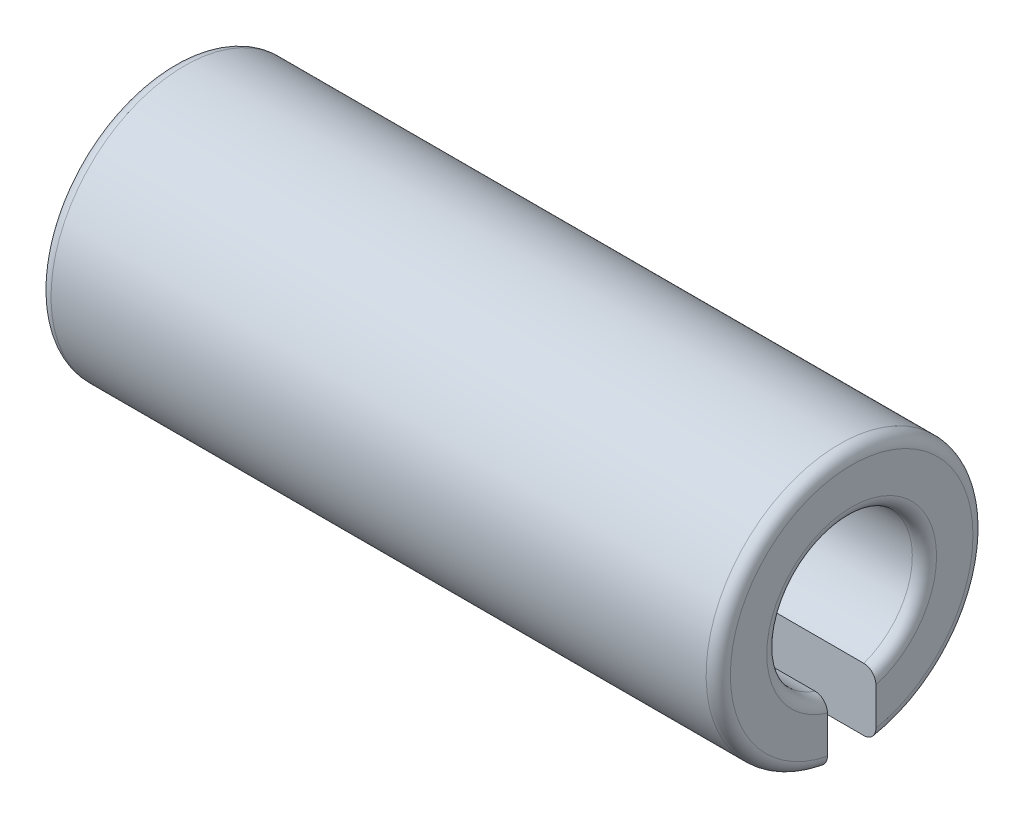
ISO-10303-21;
HEADER;
FILE_DESCRIPTION(('STEP AP214'),'2;1');
FILE_NAME('part.step','',(''),(''),'','','');
FILE_SCHEMA(('AUTOMOTIVE_DESIGN { 1 0 10303 214 1 1 1 1 }'));
ENDSEC;
DATA;
#1=APPLICATION_CONTEXT('core data for automotive mechanical design processes');
#2=APPLICATION_PROTOCOL_DEFINITION('international standard','automotive_design',2000,#1);
#3=PRODUCT_CONTEXT('',#1,'mechanical');
#4=PRODUCT('Part','Part','',(#3));
#5=PRODUCT_RELATED_PRODUCT_CATEGORY('part','',(#4));
#6=PRODUCT_DEFINITION_FORMATION('','',#4);
#7=PRODUCT_DEFINITION_CONTEXT('part definition',#1,'design');
#8=PRODUCT_DEFINITION('design','',#6,#7);
#9=PRODUCT_DEFINITION_SHAPE('','',#8);
#10=(LENGTH_UNIT() NAMED_UNIT(*) SI_UNIT(.MILLI.,.METRE.));
#11=(NAMED_UNIT(*) PLANE_ANGLE_UNIT() SI_UNIT($,.RADIAN.));
#12=(NAMED_UNIT(*) SI_UNIT($,.STERADIAN.) SOLID_ANGLE_UNIT());
#13=UNCERTAINTY_MEASURE_WITH_UNIT(LENGTH_MEASURE(1.E-05),#10,'distance_accuracy_value','');
#14=(GEOMETRIC_REPRESENTATION_CONTEXT(3) GLOBAL_UNCERTAINTY_ASSIGNED_CONTEXT((#13)) GLOBAL_UNIT_ASSIGNED_CONTEXT((#10,
#11,#12)) REPRESENTATION_CONTEXT('',''));
#15=CARTESIAN_POINT('',(0.,0.,0.));
#16=DIRECTION('',(0.,0.,1.));
#17=DIRECTION('',(1.,0.,0.));
#18=AXIS2_PLACEMENT_3D('',#15,#16,#17);
#19=CARTESIAN_POINT('',(-22.7,0.,0.));
#20=DIRECTION('',(-1.,0.,0.));
#21=DIRECTION('',(0.,0.,1.));
#22=AXIS2_PLACEMENT_3D('',#19,#20,#21);
#23=TOROIDAL_SURFACE('',#22,3.5,0.5);
#24=CARTESIAN_POINT('',(-22.7,-2.82842712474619,-1.));
#25=CARTESIAN_POINT('',(-22.6729714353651,-2.82839576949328,-1.));
#26=CARTESIAN_POINT('',(-22.6459609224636,-2.83074962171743,-1.));
#27=CARTESIAN_POINT('',(-22.5927915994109,-2.83998251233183,-1.));
#28=CARTESIAN_POINT('',(-22.5666308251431,-2.84685019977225,-0.999999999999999));
#29=CARTESIAN_POINT('',(-22.5158378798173,-2.86486624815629,-0.999999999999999));
#30=CARTESIAN_POINT('',(-22.4912054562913,-2.87601389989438,-1.));
#31=CARTESIAN_POINT('',(-22.4440888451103,-2.90218096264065,-1.));
#32=CARTESIAN_POINT('',(-22.4216053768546,-2.91720166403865,-1.));
#33=CARTESIAN_POINT('',(-22.3787598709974,-2.95106904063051,-0.999999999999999));
#34=CARTESIAN_POINT('',(-22.3584695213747,-2.97000626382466,-0.999999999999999));
#35=CARTESIAN_POINT('',(-22.321156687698,-3.01086800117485,-1.));
#36=CARTESIAN_POINT('',(-22.3041353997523,-3.03279360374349,-1.));
#37=CARTESIAN_POINT('',(-22.2729076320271,-3.08024716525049,-1.));
#38=CARTESIAN_POINT('',(-22.2588974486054,-3.10590426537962,-1.));
#39=CARTESIAN_POINT('',(-22.2351917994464,-3.15913878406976,-0.999999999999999));
#40=CARTESIAN_POINT('',(-22.2254961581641,-3.18671612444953,-0.999999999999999));
#41=CARTESIAN_POINT('',(-22.212072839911,-3.23758433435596,-1.));
#42=CARTESIAN_POINT('',(-22.2075525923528,-3.26066977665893,-1.00000000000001));
#43=CARTESIAN_POINT('',(-22.2015155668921,-3.30720181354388,-0.999999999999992));
#44=CARTESIAN_POINT('',(-22.1999952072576,-3.33064794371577,-0.999999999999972));
#45=CARTESIAN_POINT('',(-22.2,-3.35410196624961,-0.999999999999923));
#46=B_SPLINE_CURVE_WITH_KNOTS('',3,(#24,#25,#26,#27,#28,#29,#30,#31,#32,#33,#34,#35,#36,#37,#38,
#39,#40,#41,#42,#43,#44,#45),.UNSPECIFIED.,.F.,.F.,(4,2,2,2,2,2,2,2,2,2,4),(0.,
0.0809555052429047,0.161708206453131,0.242447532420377,0.323213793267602,0.406112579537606,
0.489041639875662,0.576353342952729,0.663661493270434,0.734044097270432,0.804342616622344),.UNSPECIFIED.);
#47=CARTESIAN_POINT('',(-22.7,-2.82842712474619,-1.));
#48=VERTEX_POINT('',#47);
#49=CARTESIAN_POINT('',(-22.2,-3.35410196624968,-1.));
#50=VERTEX_POINT('',#49);
#51=EDGE_CURVE('E105',#48,#50,#46,.T.);
#52=ORIENTED_EDGE('',*,*,#51,.T.);
#53=CARTESIAN_POINT('',(-22.2,0.,0.));
#54=DIRECTION('',(1.,0.,0.));
#55=DIRECTION('',(0.,-0.95831484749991,-0.285714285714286));
#56=AXIS2_PLACEMENT_3D('',#53,#54,#55);
#57=CIRCLE('',#56,3.5);
#58=CARTESIAN_POINT('',(-22.2,0.,-3.5));
#59=VERTEX_POINT('',#58);
#60=EDGE_CURVE('E183',#59,#50,#57,.F.);
#61=ORIENTED_EDGE('',*,*,#60,.F.);
#62=CARTESIAN_POINT('',(-22.2,0.,0.));
#63=DIRECTION('',(1.,0.,0.));
#64=DIRECTION('',(0.,0.,-1.));
#65=AXIS2_PLACEMENT_3D('',#62,#63,#64);
#66=CIRCLE('',#65,3.5);
#67=CARTESIAN_POINT('',(-22.2,0.,3.5));
#68=VERTEX_POINT('',#67);
#69=EDGE_CURVE('E425',#68,#59,#66,.F.);
#70=ORIENTED_EDGE('',*,*,#69,.F.);
#71=CARTESIAN_POINT('',(-22.2,0.,0.));
#72=DIRECTION('',(1.,0.,0.));
#73=DIRECTION('',(0.,0.,1.));
#74=AXIS2_PLACEMENT_3D('',#71,#72,#73);
#75=CIRCLE('',#74,3.5);
#76=CARTESIAN_POINT('',(-22.2,-3.35410196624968,0.999999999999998));
#77=VERTEX_POINT('',#76);
#78=EDGE_CURVE('E111',#77,#68,#75,.F.);
#79=ORIENTED_EDGE('',*,*,#78,.F.);
#80=CARTESIAN_POINT('',(-22.7,-2.82842712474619,0.999999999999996));
#81=CARTESIAN_POINT('',(-22.6729714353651,-2.82839576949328,0.999999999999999));
#82=CARTESIAN_POINT('',(-22.6459609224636,-2.83074962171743,0.999999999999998));
#83=CARTESIAN_POINT('',(-22.5927915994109,-2.83998251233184,0.999999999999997));
#84=CARTESIAN_POINT('',(-22.5666308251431,-2.84685019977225,0.999999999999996));
#85=CARTESIAN_POINT('',(-22.5158378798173,-2.86486624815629,0.999999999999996));
#86=CARTESIAN_POINT('',(-22.4912054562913,-2.87601389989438,0.999999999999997));
#87=CARTESIAN_POINT('',(-22.4440888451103,-2.90218096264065,0.999999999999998));
#88=CARTESIAN_POINT('',(-22.4216053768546,-2.91720166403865,0.999999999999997));
#89=CARTESIAN_POINT('',(-22.3787598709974,-2.95106904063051,0.999999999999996));
#90=CARTESIAN_POINT('',(-22.3584695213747,-2.97000626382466,0.999999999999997));
#91=CARTESIAN_POINT('',(-22.321156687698,-3.01086800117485,0.999999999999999));
#92=CARTESIAN_POINT('',(-22.3041353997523,-3.03279360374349,1.));
#93=CARTESIAN_POINT('',(-22.2729076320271,-3.08024716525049,1.));
#94=CARTESIAN_POINT('',(-22.2588974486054,-3.10590426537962,0.999999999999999));
#95=CARTESIAN_POINT('',(-22.2351917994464,-3.15913878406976,0.999999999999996));
#96=CARTESIAN_POINT('',(-22.2254961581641,-3.18671612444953,0.999999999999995));
#97=CARTESIAN_POINT('',(-22.212072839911,-3.23758433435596,1.));
#98=CARTESIAN_POINT('',(-22.2075525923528,-3.26066977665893,1.00000000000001));
#99=CARTESIAN_POINT('',(-22.2015155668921,-3.30720181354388,0.999999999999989));
#100=CARTESIAN_POINT('',(-22.1999952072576,-3.33064794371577,0.999999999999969));
#101=CARTESIAN_POINT('',(-22.2,-3.35410196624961,0.99999999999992));
#102=B_SPLINE_CURVE_WITH_KNOTS('',3,(#80,#81,#82,#83,#84,#85,#86,#87,#88,#89,#90,#91,#92,#93,
#94,#95,#96,#97,#98,#99,#100,#101),.UNSPECIFIED.,.F.,.F.,(4,2,2,2,2,2,2,2,2,2,4),(0.,
0.0809555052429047,0.161708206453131,0.24244753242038,0.323213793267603,0.406112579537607,
0.489041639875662,0.576353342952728,0.663661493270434,0.734044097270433,0.804342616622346),.UNSPECIFIED.);
#103=CARTESIAN_POINT('',(-22.7,-2.82842712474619,0.999999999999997));
#104=VERTEX_POINT('',#103);
#105=EDGE_CURVE('E109',#104,#77,#102,.T.);
#106=ORIENTED_EDGE('',*,*,#105,.F.);
#107=CARTESIAN_POINT('',(-22.7,0.,0.));
#108=DIRECTION('',(-1.,0.,0.));
#109=DIRECTION('',(0.,0.,1.));
#110=AXIS2_PLACEMENT_3D('',#107,#108,#109);
#111=CIRCLE('',#110,3.);
#112=EDGE_CURVE('E94',#104,#48,#111,.T.);
#113=ORIENTED_EDGE('',*,*,#112,.T.);
#114=EDGE_LOOP('',(#52,#61,#70,#79,#106,#113));
#115=FACE_BOUND('',#114,.T.);
#116=ADVANCED_FACE('F17',(#115),#23,.T.);
#117=CARTESIAN_POINT('',(-36.2,0.,0.));
#118=DIRECTION('',(-1.,0.,0.));
#119=DIRECTION('',(0.,0.,1.));
#120=AXIS2_PLACEMENT_3D('',#117,#118,#119);
#121=CYLINDRICAL_SURFACE('',#120,3.);
#122=CARTESIAN_POINT('',(-49.7,0.,0.));
#123=DIRECTION('',(1.,0.,0.));
#124=DIRECTION('',(0.,0.,1.));
#125=AXIS2_PLACEMENT_3D('',#122,#123,#124);
#126=CIRCLE('',#125,3.);
#127=CARTESIAN_POINT('',(-49.7,-2.82842712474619,-0.999999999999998));
#128=VERTEX_POINT('',#127);
#129=CARTESIAN_POINT('',(-49.7,-2.82842712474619,0.999999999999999));
#130=VERTEX_POINT('',#129);
#131=EDGE_CURVE('E104',#128,#130,#126,.T.);
#132=ORIENTED_EDGE('',*,*,#131,.F.);
#133=DIRECTION('',(1.,0.,0.));
#134=VECTOR('',#133,1.);
#135=CARTESIAN_POINT('',(-36.2,-2.82842712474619,-1.));
#136=LINE('',#135,#134);
#137=EDGE_CURVE('E101',#128,#48,#136,.T.);
#138=ORIENTED_EDGE('',*,*,#137,.T.);
#139=ORIENTED_EDGE('',*,*,#112,.F.);
#140=DIRECTION('',(1.,0.,0.));
#141=VECTOR('',#140,1.);
#142=CARTESIAN_POINT('',(-36.2,-2.82842712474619,0.999999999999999));
#143=LINE('',#142,#141);
#144=EDGE_CURVE('E98',#130,#104,#143,.T.);
#145=ORIENTED_EDGE('',*,*,#144,.F.);
#146=EDGE_LOOP('',(#132,#138,#139,#145));
#147=FACE_BOUND('',#146,.T.);
#148=ADVANCED_FACE('F96',(#147),#121,.F.);
#149=CARTESIAN_POINT('',(-49.7,0.,0.));
#150=DIRECTION('',(1.,0.,0.));
#151=DIRECTION('',(0.,0.,1.));
#152=AXIS2_PLACEMENT_3D('',#149,#150,#151);
#153=TOROIDAL_SURFACE('',#152,3.5,0.5);
#154=CARTESIAN_POINT('',(-50.2,-3.35410196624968,0.999999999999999));
#155=CARTESIAN_POINT('',(-50.2000183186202,-3.32351683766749,1.));
#156=CARTESIAN_POINT('',(-50.1974236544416,-3.29293730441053,1.));
#157=CARTESIAN_POINT('',(-50.1871760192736,-3.23262975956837,0.999999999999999));
#158=CARTESIAN_POINT('',(-50.1795218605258,-3.20290194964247,0.999999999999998));
#159=CARTESIAN_POINT('',(-50.1593168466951,-3.14513562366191,0.999999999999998));
#160=CARTESIAN_POINT('',(-50.1467629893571,-3.11709815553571,0.999999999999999));
#161=CARTESIAN_POINT('',(-50.1170635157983,-3.06357753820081,0.999999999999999));
#162=CARTESIAN_POINT('',(-50.0999195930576,-3.0380934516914,0.999999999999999));
#163=CARTESIAN_POINT('',(-50.061736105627,-2.99084771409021,0.999999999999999));
#164=CARTESIAN_POINT('',(-50.0407578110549,-2.96903664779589,0.999999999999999));
#165=CARTESIAN_POINT('',(-49.9952832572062,-2.92946136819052,0.999999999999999));
#166=CARTESIAN_POINT('',(-49.9707888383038,-2.91169505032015,1.));
#167=CARTESIAN_POINT('',(-49.9201787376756,-2.88161560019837,1.));
#168=CARTESIAN_POINT('',(-49.8941900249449,-2.86908866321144,0.999999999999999));
#169=CARTESIAN_POINT('',(-49.8404130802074,-2.8488666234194,1.));
#170=CARTESIAN_POINT('',(-49.8126275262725,-2.84116450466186,1.));
#171=CARTESIAN_POINT('',(-49.7704753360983,-2.83350618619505,1.));
#172=CARTESIAN_POINT('',(-49.7564383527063,-2.83160259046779,0.999999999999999));
#173=CARTESIAN_POINT('',(-49.728270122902,-2.8290637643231,0.999999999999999));
#174=CARTESIAN_POINT('',(-49.7141390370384,-2.82842675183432,1.));
#175=CARTESIAN_POINT('',(-49.7,-2.82842712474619,1.));
#176=B_SPLINE_CURVE_WITH_KNOTS('',3,(#154,#155,#156,#157,#158,#159,#160,#161,#162,#163,#164,
#165,#166,#167,#168,#169,#170,#171,#172,#173,#174,#175),.UNSPECIFIED.,.F.,.F.,(4,2,2,2,2,2,2,2,
2,2,4),(0.,0.091638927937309,0.183299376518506,0.275016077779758,0.36669898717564,
0.457027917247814,0.547309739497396,0.633425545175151,0.719415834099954,0.761862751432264,
0.804249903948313),.UNSPECIFIED.);
#177=CARTESIAN_POINT('',(-50.2,-3.35410196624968,1.));
#178=VERTEX_POINT('',#177);
#179=EDGE_CURVE('E120',#178,#130,#176,.T.);
#180=ORIENTED_EDGE('',*,*,#179,.F.);
#181=CARTESIAN_POINT('',(-50.2,0.,0.));
#182=DIRECTION('',(-1.,0.,0.));
#183=DIRECTION('',(0.,-0.95831484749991,0.285714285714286));
#184=AXIS2_PLACEMENT_3D('',#181,#182,#183);
#185=CIRCLE('',#184,3.5);
#186=CARTESIAN_POINT('',(-50.2,0.,3.5));
#187=VERTEX_POINT('',#186);
#188=EDGE_CURVE('E306',#187,#178,#185,.F.);
#189=ORIENTED_EDGE('',*,*,#188,.F.);
#190=CARTESIAN_POINT('',(-50.2,0.,0.));
#191=DIRECTION('',(-1.,0.,0.));
#192=DIRECTION('',(0.,0.,1.));
#193=AXIS2_PLACEMENT_3D('',#190,#191,#192);
#194=CIRCLE('',#193,3.5);
#195=CARTESIAN_POINT('',(-50.2,0.,-3.5));
#196=VERTEX_POINT('',#195);
#197=EDGE_CURVE('E296',#196,#187,#194,.F.);
#198=ORIENTED_EDGE('',*,*,#197,.F.);
#199=CARTESIAN_POINT('',(-50.2,0.,0.));
#200=DIRECTION('',(-1.,0.,0.));
#201=DIRECTION('',(0.,0.,-1.));
#202=AXIS2_PLACEMENT_3D('',#199,#200,#201);
#203=CIRCLE('',#202,3.5);
#204=CARTESIAN_POINT('',(-50.2,-3.35410196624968,-1.));
#205=VERTEX_POINT('',#204);
#206=EDGE_CURVE('E285',#205,#196,#203,.F.);
#207=ORIENTED_EDGE('',*,*,#206,.F.);
#208=CARTESIAN_POINT('',(-50.2,-3.35410196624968,-0.999999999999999));
#209=CARTESIAN_POINT('',(-50.2000183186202,-3.32351683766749,-0.999999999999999));
#210=CARTESIAN_POINT('',(-50.1974236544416,-3.29293730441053,-0.999999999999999));
#211=CARTESIAN_POINT('',(-50.1871760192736,-3.23262975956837,-0.999999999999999));
#212=CARTESIAN_POINT('',(-50.1795218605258,-3.20290194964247,-1.));
#213=CARTESIAN_POINT('',(-50.1593168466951,-3.14513562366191,-0.999999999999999));
#214=CARTESIAN_POINT('',(-50.1467629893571,-3.11709815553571,-0.999999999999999));
#215=CARTESIAN_POINT('',(-50.1170635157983,-3.06357753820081,-0.999999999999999));
#216=CARTESIAN_POINT('',(-50.0999195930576,-3.0380934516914,-1.));
#217=CARTESIAN_POINT('',(-50.061736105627,-2.99084771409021,-1.));
#218=CARTESIAN_POINT('',(-50.0407578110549,-2.96903664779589,-0.999999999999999));
#219=CARTESIAN_POINT('',(-49.9952832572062,-2.92946136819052,-0.999999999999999));
#220=CARTESIAN_POINT('',(-49.9707888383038,-2.91169505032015,-0.999999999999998));
#221=CARTESIAN_POINT('',(-49.9201787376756,-2.88161560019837,-0.999999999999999));
#222=CARTESIAN_POINT('',(-49.8941900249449,-2.86908866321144,-0.999999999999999));
#223=CARTESIAN_POINT('',(-49.8404130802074,-2.8488666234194,-0.999999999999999));
#224=CARTESIAN_POINT('',(-49.8126275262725,-2.84116450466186,-0.999999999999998));
#225=CARTESIAN_POINT('',(-49.7704753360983,-2.83350618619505,-0.999999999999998));
#226=CARTESIAN_POINT('',(-49.7564383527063,-2.83160259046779,-0.999999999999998));
#227=CARTESIAN_POINT('',(-49.728270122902,-2.8290637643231,-1.));
#228=CARTESIAN_POINT('',(-49.7141390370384,-2.82842675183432,-1.));
#229=CARTESIAN_POINT('',(-49.7,-2.82842712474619,-1.));
#230=B_SPLINE_CURVE_WITH_KNOTS('',3,(#208,#209,#210,#211,#212,#213,#214,#215,#216,#217,#218,
#219,#220,#221,#222,#223,#224,#225,#226,#227,#228,#229),.UNSPECIFIED.,.F.,.F.,(4,2,2,2,2,2,2,2,
2,2,4),(0.,0.091638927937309,0.183299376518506,0.275016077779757,0.366698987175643,
0.457027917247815,0.547309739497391,0.633425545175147,0.71941583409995,0.761862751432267,
0.804249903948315),.UNSPECIFIED.);
#231=EDGE_CURVE('E203',#205,#128,#230,.T.);
#232=ORIENTED_EDGE('',*,*,#231,.T.);
#233=ORIENTED_EDGE('',*,*,#131,.T.);
#234=EDGE_LOOP('',(#180,#189,#198,#207,#232,#233));
#235=FACE_BOUND('',#234,.T.);
#236=ADVANCED_FACE('F141',(#235),#153,.T.);
#237=CARTESIAN_POINT('',(-36.2,-5.5,0.999999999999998));
#238=DIRECTION('',(0.,0.,-1.));
#239=DIRECTION('',(0.,1.,0.));
#240=AXIS2_PLACEMENT_3D('',#237,#238,#239);
#241=PLANE('',#240);
#242=ORIENTED_EDGE('',*,*,#179,.T.);
#243=ORIENTED_EDGE('',*,*,#144,.T.);
#244=ORIENTED_EDGE('',*,*,#105,.T.);
#245=DIRECTION('',(0.,1.,0.));
#246=VECTOR('',#245,1.);
#247=CARTESIAN_POINT('',(-22.2,0.,0.999999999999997));
#248=LINE('',#247,#246);
#249=CARTESIAN_POINT('',(-22.2,-4.89897948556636,0.999999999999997));
#250=VERTEX_POINT('',#249);
#251=EDGE_CURVE('E438',#250,#77,#248,.T.);
#252=ORIENTED_EDGE('',*,*,#251,.F.);
#253=CARTESIAN_POINT('',(-22.7,-5.40832691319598,0.999999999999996));
#254=CARTESIAN_POINT('',(-22.6722194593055,-5.40835258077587,0.999999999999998));
#255=CARTESIAN_POINT('',(-22.6444485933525,-5.40597401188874,0.999999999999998));
#256=CARTESIAN_POINT('',(-22.5897308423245,-5.39660080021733,0.999999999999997));
#257=CARTESIAN_POINT('',(-22.5627829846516,-5.38961184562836,0.999999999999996));
#258=CARTESIAN_POINT('',(-22.5104350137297,-5.37120635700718,0.999999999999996));
#259=CARTESIAN_POINT('',(-22.4850354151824,-5.35978835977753,0.999999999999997));
#260=CARTESIAN_POINT('',(-22.4364976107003,-5.33288110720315,0.999999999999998));
#261=CARTESIAN_POINT('',(-22.4133592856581,-5.31739206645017,0.999999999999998));
#262=CARTESIAN_POINT('',(-22.3698160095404,-5.28268052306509,0.999999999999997));
#263=CARTESIAN_POINT('',(-22.3494309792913,-5.26343304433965,0.999999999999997));
#264=CARTESIAN_POINT('',(-22.3121187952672,-5.22183524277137,0.999999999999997));
#265=CARTESIAN_POINT('',(-22.2951920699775,-5.19948453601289,0.999999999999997));
#266=CARTESIAN_POINT('',(-22.26498473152,-5.15193571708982,0.999999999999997));
#267=CARTESIAN_POINT('',(-22.2517673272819,-5.12669749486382,0.999999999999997));
#268=CARTESIAN_POINT('',(-22.2296787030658,-5.07438923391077,0.999999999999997));
#269=CARTESIAN_POINT('',(-22.2208062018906,-5.04731973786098,0.999999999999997));
#270=CARTESIAN_POINT('',(-22.2094859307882,-4.99994957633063,0.999999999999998));
#271=CARTESIAN_POINT('',(-22.2059297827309,-4.97990601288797,0.999999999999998));
#272=CARTESIAN_POINT('',(-22.201186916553,-4.93957027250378,0.999999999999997));
#273=CARTESIAN_POINT('',(-22.1999967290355,-4.91927850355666,0.999999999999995));
#274=CARTESIAN_POINT('',(-22.2,-4.89897948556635,0.999999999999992));
#275=B_SPLINE_CURVE_WITH_KNOTS('',3,(#253,#254,#255,#256,#257,#258,#259,#260,#261,#262,#263,
#264,#265,#266,#267,#268,#269,#270,#271,#272,#273,#274),.UNSPECIFIED.,.F.,.F.,(4,2,2,2,2,2,2,2,
2,2,4),(0.,0.0832256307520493,0.166348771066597,0.249499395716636,0.332645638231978,
0.416364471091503,0.500093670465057,0.585173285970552,0.670227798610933,0.731165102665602,
0.7920129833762),.UNSPECIFIED.);
#276=CARTESIAN_POINT('',(-22.7,-5.40832691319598,0.999999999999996));
#277=VERTEX_POINT('',#276);
#278=EDGE_CURVE('E121',#277,#250,#275,.T.);
#279=ORIENTED_EDGE('',*,*,#278,.F.);
#280=DIRECTION('',(-1.,0.,0.));
#281=VECTOR('',#280,1.);
#282=CARTESIAN_POINT('',(-36.2,-5.40832691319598,0.999999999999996));
#283=LINE('',#282,#281);
#284=CARTESIAN_POINT('',(-49.7,-5.40832691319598,0.999999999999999));
#285=VERTEX_POINT('',#284);
#286=EDGE_CURVE('E129',#285,#277,#283,.F.);
#287=ORIENTED_EDGE('',*,*,#286,.F.);
#288=CARTESIAN_POINT('',(-49.7,-5.40832691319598,1.));
#289=CARTESIAN_POINT('',(-49.7277805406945,-5.40835258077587,1.));
#290=CARTESIAN_POINT('',(-49.7555514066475,-5.40597401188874,0.999999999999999));
#291=CARTESIAN_POINT('',(-49.8102691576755,-5.39660080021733,0.999999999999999));
#292=CARTESIAN_POINT('',(-49.8372170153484,-5.38961184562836,0.999999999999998));
#293=CARTESIAN_POINT('',(-49.8895649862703,-5.37120635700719,0.999999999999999));
#294=CARTESIAN_POINT('',(-49.9149645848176,-5.35978835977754,0.999999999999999));
#295=CARTESIAN_POINT('',(-49.9635023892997,-5.33288110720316,0.999999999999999));
#296=CARTESIAN_POINT('',(-49.9866407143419,-5.31739206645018,0.999999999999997));
#297=CARTESIAN_POINT('',(-50.0301839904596,-5.2826805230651,0.999999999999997));
#298=CARTESIAN_POINT('',(-50.0505690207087,-5.26343304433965,0.999999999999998));
#299=CARTESIAN_POINT('',(-50.0878812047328,-5.22183524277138,1.));
#300=CARTESIAN_POINT('',(-50.1048079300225,-5.1994845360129,1.));
#301=CARTESIAN_POINT('',(-50.13501526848,-5.15193571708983,1.));
#302=CARTESIAN_POINT('',(-50.1482326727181,-5.12669749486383,0.999999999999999));
#303=CARTESIAN_POINT('',(-50.1703212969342,-5.07438923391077,0.999999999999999));
#304=CARTESIAN_POINT('',(-50.1791937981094,-5.04731973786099,1.));
#305=CARTESIAN_POINT('',(-50.1905140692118,-4.99994957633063,1.));
#306=CARTESIAN_POINT('',(-50.1940702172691,-4.97990601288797,1.));
#307=CARTESIAN_POINT('',(-50.198813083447,-4.93957027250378,0.999999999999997));
#308=CARTESIAN_POINT('',(-50.2000032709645,-4.91927850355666,0.999999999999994));
#309=CARTESIAN_POINT('',(-50.2,-4.89897948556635,0.999999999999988));
#310=B_SPLINE_CURVE_WITH_KNOTS('',3,(#288,#289,#290,#291,#292,#293,#294,#295,#296,#297,#298,
#299,#300,#301,#302,#303,#304,#305,#306,#307,#308,#309),.UNSPECIFIED.,.F.,.F.,(4,2,2,2,2,2,2,2,
2,2,4),(0.,0.0832256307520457,0.166348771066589,0.249499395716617,0.332645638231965,
0.41636447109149,0.500093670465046,0.585173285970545,0.670227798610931,0.731165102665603,
0.7920129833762),.UNSPECIFIED.);
#311=CARTESIAN_POINT('',(-50.2,-4.89897948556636,0.999999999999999));
#312=VERTEX_POINT('',#311);
#313=EDGE_CURVE('E115',#285,#312,#310,.T.);
#314=ORIENTED_EDGE('',*,*,#313,.T.);
#315=DIRECTION('',(0.,1.,0.));
#316=VECTOR('',#315,1.);
#317=CARTESIAN_POINT('',(-50.2,0.,1.));
#318=LINE('',#317,#316);
#319=EDGE_CURVE('E339',#178,#312,#318,.F.);
#320=ORIENTED_EDGE('',*,*,#319,.F.);
#321=EDGE_LOOP('',(#242,#243,#244,#252,#279,#287,#314,#320));
#322=FACE_BOUND('',#321,.T.);
#323=ADVANCED_FACE('F117',(#322),#241,.T.);
#324=CARTESIAN_POINT('',(-22.2,0.,0.));
#325=DIRECTION('',(1.,0.,0.));
#326=DIRECTION('',(0.,0.,-1.));
#327=AXIS2_PLACEMENT_3D('',#324,#325,#326);
#328=PLANE('',#327);
#329=ORIENTED_EDGE('',*,*,#69,.T.);
#330=ORIENTED_EDGE('',*,*,#60,.T.);
#331=DIRECTION('',(0.,1.,0.));
#332=VECTOR('',#331,1.);
#333=CARTESIAN_POINT('',(-22.2,-5.5,-1.));
#334=LINE('',#333,#332);
#335=CARTESIAN_POINT('',(-22.2,-4.89897948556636,-1.));
#336=VERTEX_POINT('',#335);
#337=EDGE_CURVE('E227',#50,#336,#334,.F.);
#338=ORIENTED_EDGE('',*,*,#337,.T.);
#339=CARTESIAN_POINT('',(-22.2,0.,0.));
#340=DIRECTION('',(-1.,0.,0.));
#341=DIRECTION('',(0.,0.,-1.));
#342=AXIS2_PLACEMENT_3D('',#339,#340,#341);
#343=CIRCLE('',#342,5.);
#344=CARTESIAN_POINT('',(-22.2,0.,-5.));
#345=VERTEX_POINT('',#344);
#346=EDGE_CURVE('E232',#345,#336,#343,.T.);
#347=ORIENTED_EDGE('',*,*,#346,.F.);
#348=CARTESIAN_POINT('',(-22.2,0.,0.));
#349=DIRECTION('',(-1.,0.,0.));
#350=DIRECTION('',(0.,0.,1.));
#351=AXIS2_PLACEMENT_3D('',#348,#349,#350);
#352=CIRCLE('',#351,5.);
#353=CARTESIAN_POINT('',(-22.2,0.,5.));
#354=VERTEX_POINT('',#353);
#355=EDGE_CURVE('E221',#354,#345,#352,.T.);
#356=ORIENTED_EDGE('',*,*,#355,.F.);
#357=CARTESIAN_POINT('',(-22.2,0.,0.));
#358=DIRECTION('',(-1.,0.,0.));
#359=DIRECTION('',(0.,-0.979795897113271,0.2));
#360=AXIS2_PLACEMENT_3D('',#357,#358,#359);
#361=CIRCLE('',#360,5.);
#362=EDGE_CURVE('E124',#354,#250,#361,.F.);
#363=ORIENTED_EDGE('',*,*,#362,.T.);
#364=ORIENTED_EDGE('',*,*,#251,.T.);
#365=ORIENTED_EDGE('',*,*,#78,.T.);
#366=EDGE_LOOP('',(#329,#330,#338,#347,#356,#363,#364,#365));
#367=FACE_BOUND('',#366,.T.);
#368=ADVANCED_FACE('F240',(#367),#328,.T.);
#369=CARTESIAN_POINT('',(-36.2,-5.5,-1.));
#370=DIRECTION('',(0.,0.,-1.));
#371=DIRECTION('',(0.,1.,0.));
#372=AXIS2_PLACEMENT_3D('',#369,#370,#371);
#373=PLANE('',#372);
#374=ORIENTED_EDGE('',*,*,#137,.F.);
#375=ORIENTED_EDGE('',*,*,#231,.F.);
#376=DIRECTION('',(0.,1.,0.));
#377=VECTOR('',#376,1.);
#378=CARTESIAN_POINT('',(-50.2,0.,-1.));
#379=LINE('',#378,#377);
#380=CARTESIAN_POINT('',(-50.2,-4.89897948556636,-1.));
#381=VERTEX_POINT('',#380);
#382=EDGE_CURVE('E197',#381,#205,#379,.T.);
#383=ORIENTED_EDGE('',*,*,#382,.F.);
#384=CARTESIAN_POINT('',(-49.7,-5.40832691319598,-1.));
#385=CARTESIAN_POINT('',(-49.7277805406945,-5.40835258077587,-1.));
#386=CARTESIAN_POINT('',(-49.7555514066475,-5.40597401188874,-1.));
#387=CARTESIAN_POINT('',(-49.8102691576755,-5.39660080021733,-0.999999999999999));
#388=CARTESIAN_POINT('',(-49.8372170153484,-5.38961184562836,-0.999999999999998));
#389=CARTESIAN_POINT('',(-49.8895649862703,-5.37120635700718,-0.999999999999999));
#390=CARTESIAN_POINT('',(-49.9149645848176,-5.35978835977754,-1.));
#391=CARTESIAN_POINT('',(-49.9635023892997,-5.33288110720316,-0.999999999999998));
#392=CARTESIAN_POINT('',(-49.9866407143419,-5.31739206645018,-0.999999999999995));
#393=CARTESIAN_POINT('',(-50.0301839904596,-5.2826805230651,-0.999999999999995));
#394=CARTESIAN_POINT('',(-50.0505690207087,-5.26343304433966,-0.999999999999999));
#395=CARTESIAN_POINT('',(-50.0878812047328,-5.22183524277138,-1.));
#396=CARTESIAN_POINT('',(-50.1048079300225,-5.19948453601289,-0.999999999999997));
#397=CARTESIAN_POINT('',(-50.13501526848,-5.15193571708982,-0.999999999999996));
#398=CARTESIAN_POINT('',(-50.1482326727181,-5.12669749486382,-0.999999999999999));
#399=CARTESIAN_POINT('',(-50.1703212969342,-5.07438923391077,-1.));
#400=CARTESIAN_POINT('',(-50.1791937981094,-5.04731973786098,-0.999999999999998));
#401=CARTESIAN_POINT('',(-50.1905140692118,-4.99994957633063,-0.999999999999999));
#402=CARTESIAN_POINT('',(-50.1940702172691,-4.97990601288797,-1.));
#403=CARTESIAN_POINT('',(-50.1988130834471,-4.93957027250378,-0.999999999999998));
#404=CARTESIAN_POINT('',(-50.2000032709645,-4.91927850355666,-0.999999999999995));
#405=CARTESIAN_POINT('',(-50.2,-4.89897948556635,-0.999999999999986));
#406=B_SPLINE_CURVE_WITH_KNOTS('',3,(#384,#385,#386,#387,#388,#389,#390,#391,#392,#393,#394,
#395,#396,#397,#398,#399,#400,#401,#402,#403,#404,#405),.UNSPECIFIED.,.F.,.F.,(4,2,2,2,2,2,2,2,
2,2,4),(0.,0.0832256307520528,0.166348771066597,0.249499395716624,0.332645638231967,
0.416364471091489,0.500093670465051,0.585173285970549,0.670227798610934,0.731165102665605,
0.792012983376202),.UNSPECIFIED.);
#407=CARTESIAN_POINT('',(-49.7,-5.40832691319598,-1.));
#408=VERTEX_POINT('',#407);
#409=EDGE_CURVE('E194',#408,#381,#406,.T.);
#410=ORIENTED_EDGE('',*,*,#409,.F.);
#411=DIRECTION('',(-1.,0.,0.));
#412=VECTOR('',#411,1.);
#413=CARTESIAN_POINT('',(-36.2,-5.40832691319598,-1.));
#414=LINE('',#413,#412);
#415=CARTESIAN_POINT('',(-22.7,-5.40832691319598,-1.));
#416=VERTEX_POINT('',#415);
#417=EDGE_CURVE('E218',#416,#408,#414,.T.);
#418=ORIENTED_EDGE('',*,*,#417,.F.);
#419=CARTESIAN_POINT('',(-22.2,-4.89897948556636,-1.));
#420=CARTESIAN_POINT('',(-22.1999775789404,-4.9280511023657,-1.00000000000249));
#421=CARTESIAN_POINT('',(-22.2024328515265,-4.95712047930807,-1.00000000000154));
#422=CARTESIAN_POINT('',(-22.2121496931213,-5.01444087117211,-0.999999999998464));
#423=CARTESIAN_POINT('',(-22.2194106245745,-5.04269199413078,-0.999999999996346));
#424=CARTESIAN_POINT('',(-22.2385970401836,-5.09759095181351,-0.999999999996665));
#425=CARTESIAN_POINT('',(-22.2505260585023,-5.12423755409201,-0.999999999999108));
#426=CARTESIAN_POINT('',(-22.2787310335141,-5.17511084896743,-1.00000000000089));
#427=CARTESIAN_POINT('',(-22.2950053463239,-5.19933845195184,-1.00000000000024));
#428=CARTESIAN_POINT('',(-22.3312716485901,-5.24440776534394,-0.999999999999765));
#429=CARTESIAN_POINT('',(-22.3512223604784,-5.26528267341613,-0.999999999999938));
#430=CARTESIAN_POINT('',(-22.3944006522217,-5.30331043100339,-1.00000000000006));
#431=CARTESIAN_POINT('',(-22.4176276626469,-5.32046392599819,-1.00000000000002));
#432=CARTESIAN_POINT('',(-22.4662610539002,-5.35024658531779,-0.999999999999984));
#433=CARTESIAN_POINT('',(-22.4916224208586,-5.36294935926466,-0.999999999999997));
#434=CARTESIAN_POINT('',(-22.5441322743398,-5.38383556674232,-1.00000000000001));
#435=CARTESIAN_POINT('',(-22.5712792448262,-5.39202278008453,-1.));
#436=CARTESIAN_POINT('',(-22.6155295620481,-5.40131614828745,-1.));
#437=CARTESIAN_POINT('',(-22.6323280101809,-5.40394377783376,-1.));
#438=CARTESIAN_POINT('',(-22.6660816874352,-5.40744863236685,-0.999999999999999));
#439=CARTESIAN_POINT('',(-22.6830366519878,-5.40832840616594,-0.999999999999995));
#440=CARTESIAN_POINT('',(-22.7,-5.40832691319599,-0.999999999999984));
#441=B_SPLINE_CURVE_WITH_KNOTS('',3,(#419,#420,#421,#422,#423,#424,#425,#426,#427,#428,#429,
#430,#431,#432,#433,#434,#435,#436,#437,#438,#439,#440),.UNSPECIFIED.,.F.,.F.,(4,2,2,2,2,2,2,2,
2,2,4),(0.,0.0871088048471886,0.174206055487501,0.261369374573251,0.348499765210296,
0.434705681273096,0.520896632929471,0.60558611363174,0.690204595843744,0.741129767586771,
0.791980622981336),.UNSPECIFIED.);
#442=EDGE_CURVE('E231',#336,#416,#441,.T.);
#443=ORIENTED_EDGE('',*,*,#442,.F.);
#444=ORIENTED_EDGE('',*,*,#337,.F.);
#445=ORIENTED_EDGE('',*,*,#51,.F.);
#446=EDGE_LOOP('',(#374,#375,#383,#410,#418,#443,#444,#445));
#447=FACE_BOUND('',#446,.T.);
#448=ADVANCED_FACE('F167',(#447),#373,.F.);
#449=CARTESIAN_POINT('',(-50.2,0.,0.));
#450=DIRECTION('',(-1.,0.,0.));
#451=DIRECTION('',(0.,0.,1.));
#452=AXIS2_PLACEMENT_3D('',#449,#450,#451);
#453=PLANE('',#452);
#454=CARTESIAN_POINT('',(-50.2,0.,0.));
#455=DIRECTION('',(1.,0.,0.));
#456=DIRECTION('',(0.,0.,-1.));
#457=AXIS2_PLACEMENT_3D('',#454,#455,#456);
#458=CIRCLE('',#457,5.);
#459=CARTESIAN_POINT('',(-50.2,0.,-5.));
#460=VERTEX_POINT('',#459);
#461=CARTESIAN_POINT('',(-50.2,0.,5.));
#462=VERTEX_POINT('',#461);
#463=EDGE_CURVE('E220',#460,#462,#458,.T.);
#464=ORIENTED_EDGE('',*,*,#463,.F.);
#465=CARTESIAN_POINT('',(-50.2,0.,0.));
#466=DIRECTION('',(1.,0.,0.));
#467=DIRECTION('',(0.,-0.979795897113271,-0.200000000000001));
#468=AXIS2_PLACEMENT_3D('',#465,#466,#467);
#469=CIRCLE('',#468,5.);
#470=EDGE_CURVE('E335',#460,#381,#469,.F.);
#471=ORIENTED_EDGE('',*,*,#470,.T.);
#472=ORIENTED_EDGE('',*,*,#382,.T.);
#473=ORIENTED_EDGE('',*,*,#206,.T.);
#474=ORIENTED_EDGE('',*,*,#197,.T.);
#475=ORIENTED_EDGE('',*,*,#188,.T.);
#476=ORIENTED_EDGE('',*,*,#319,.T.);
#477=CARTESIAN_POINT('',(-50.2,0.,0.));
#478=DIRECTION('',(1.,0.,0.));
#479=DIRECTION('',(0.,0.,1.));
#480=AXIS2_PLACEMENT_3D('',#477,#478,#479);
#481=CIRCLE('',#480,5.);
#482=EDGE_CURVE('E38',#312,#462,#481,.F.);
#483=ORIENTED_EDGE('',*,*,#482,.T.);
#484=EDGE_LOOP('',(#464,#471,#472,#473,#474,#475,#476,#483));
#485=FACE_BOUND('',#484,.T.);
#486=ADVANCED_FACE('F208',(#485),#453,.T.);
#487=CARTESIAN_POINT('',(-22.7,0.,0.));
#488=DIRECTION('',(1.,0.,0.));
#489=DIRECTION('',(0.,0.,1.));
#490=AXIS2_PLACEMENT_3D('',#487,#488,#489);
#491=TOROIDAL_SURFACE('',#490,5.,0.5);
#492=CARTESIAN_POINT('',(-22.7,0.,0.));
#493=DIRECTION('',(-1.,0.,0.));
#494=DIRECTION('',(0.,0.,1.));
#495=AXIS2_PLACEMENT_3D('',#492,#493,#494);
#496=CIRCLE('',#495,5.5);
#497=EDGE_CURVE('E29',#277,#416,#496,.T.);
#498=ORIENTED_EDGE('',*,*,#497,.F.);
#499=ORIENTED_EDGE('',*,*,#278,.T.);
#500=ORIENTED_EDGE('',*,*,#362,.F.);
#501=ORIENTED_EDGE('',*,*,#355,.T.);
#502=ORIENTED_EDGE('',*,*,#346,.T.);
#503=ORIENTED_EDGE('',*,*,#442,.T.);
#504=EDGE_LOOP('',(#498,#499,#500,#501,#502,#503));
#505=FACE_BOUND('',#504,.T.);
#506=ADVANCED_FACE('F261',(#505),#491,.T.);
#507=CARTESIAN_POINT('',(-49.7,0.,0.));
#508=DIRECTION('',(-1.,0.,0.));
#509=DIRECTION('',(0.,0.,1.));
#510=AXIS2_PLACEMENT_3D('',#507,#508,#509);
#511=TOROIDAL_SURFACE('',#510,5.,0.5);
#512=ORIENTED_EDGE('',*,*,#463,.T.);
#513=ORIENTED_EDGE('',*,*,#482,.F.);
#514=ORIENTED_EDGE('',*,*,#313,.F.);
#515=CARTESIAN_POINT('',(-49.7,0.,0.));
#516=DIRECTION('',(-1.,0.,0.));
#517=DIRECTION('',(0.,0.,1.));
#518=AXIS2_PLACEMENT_3D('',#515,#516,#517);
#519=CIRCLE('',#518,5.5);
#520=EDGE_CURVE('E11',#408,#285,#519,.F.);
#521=ORIENTED_EDGE('',*,*,#520,.F.);
#522=ORIENTED_EDGE('',*,*,#409,.T.);
#523=ORIENTED_EDGE('',*,*,#470,.F.);
#524=EDGE_LOOP('',(#512,#513,#514,#521,#522,#523));
#525=FACE_BOUND('',#524,.T.);
#526=ADVANCED_FACE('F270',(#525),#511,.T.);
#527=CARTESIAN_POINT('',(-36.2,0.,0.));
#528=DIRECTION('',(-1.,0.,0.));
#529=DIRECTION('',(0.,0.,1.));
#530=AXIS2_PLACEMENT_3D('',#527,#528,#529);
#531=CYLINDRICAL_SURFACE('',#530,5.5);
#532=ORIENTED_EDGE('',*,*,#497,.T.);
#533=ORIENTED_EDGE('',*,*,#417,.T.);
#534=ORIENTED_EDGE('',*,*,#520,.T.);
#535=ORIENTED_EDGE('',*,*,#286,.T.);
#536=EDGE_LOOP('',(#532,#533,#534,#535));
#537=FACE_BOUND('',#536,.T.);
#538=ADVANCED_FACE('F360',(#537),#531,.T.);
#539=CLOSED_SHELL('',(#116,#148,#236,#323,#368,#448,#486,#506,#526,#538));
#540=MANIFOLD_SOLID_BREP('B1',#539);
#541=ADVANCED_BREP_SHAPE_REPRESENTATION('',(#18,#540),#14);
#542=SHAPE_DEFINITION_REPRESENTATION(#9,#541);
ENDSEC;
END-ISO-10303-21;
